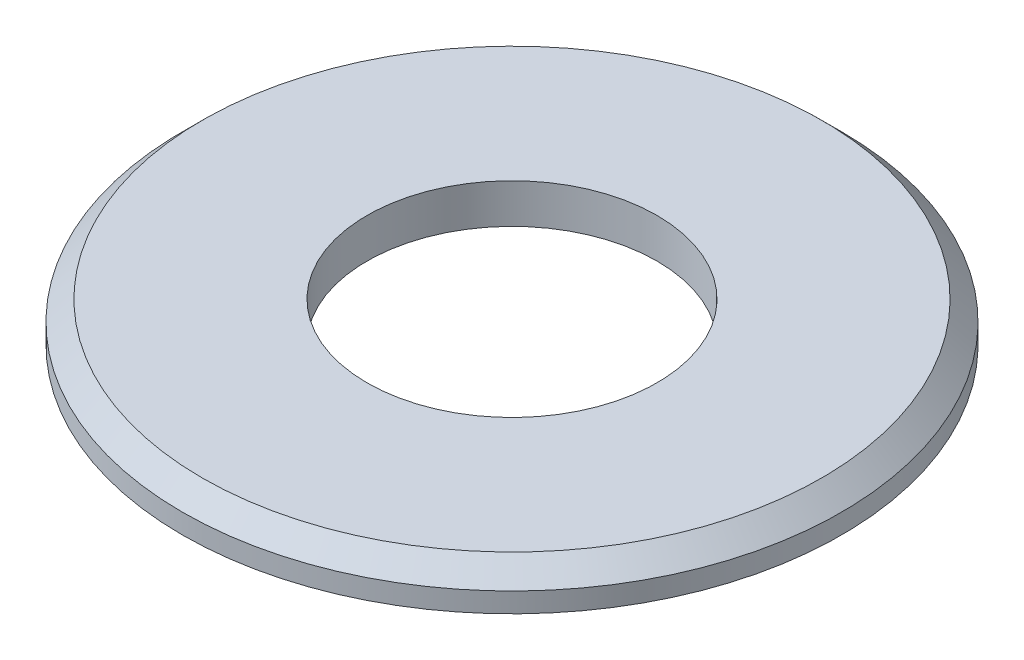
from build123d import *

# Parameters (mm, degrees)
SKETCH1_R      = 2.5
SKETCH1_R_2    = 1.1
EXTRUDE1_DEPTH = 0.3
CHAMFER1_SIZE  = 0.15


with BuildPart() as part:
    # Sketch1 → Extrude1 (new body)
    with BuildSketch(Plane(origin=(0, 0, 0), x_dir=(1, 0, 0), z_dir=(0, 1, 0))):
        with Locations(Location((0, 0, 0), (0, 0, 270))):
            Circle(SKETCH1_R)
        with Locations(Location((0, 0, 0), (0, 0, 270))):
            Circle(SKETCH1_R_2, mode=Mode.SUBTRACT)
    extrude(amount=EXTRUDE1_DEPTH)

    # Chamfer1
    chamfer1_edges = [part.edges().sort_by_distance(p)[0] for p in [
        (0, 0.3, -2.5),
    ]]
    chamfer(chamfer1_edges, length=CHAMFER1_SIZE)


solid = part.part
